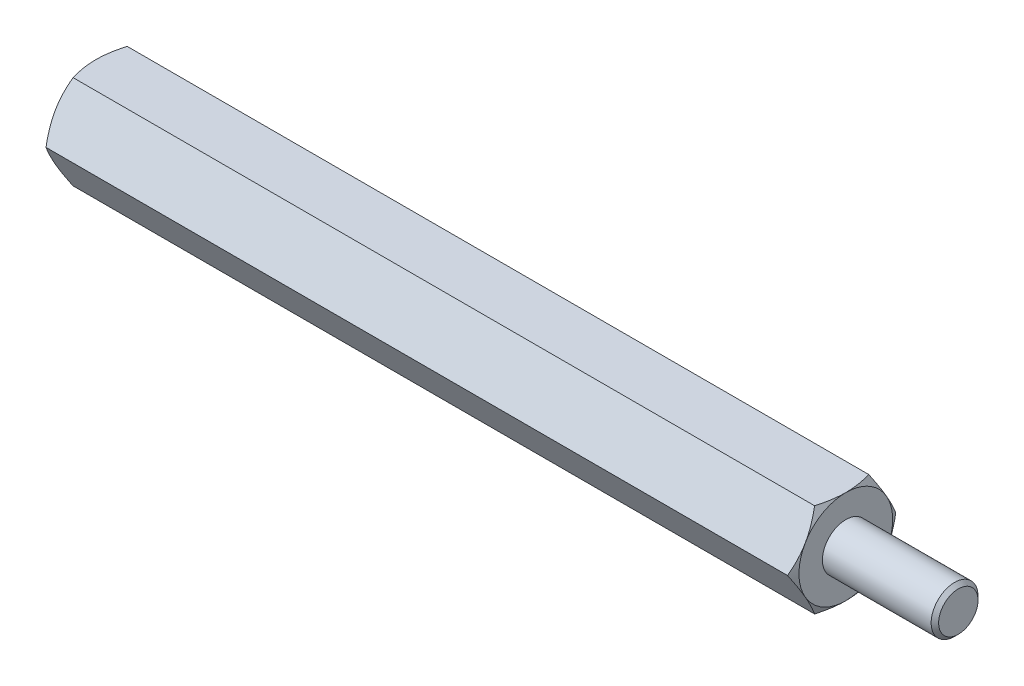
ISO-10303-21;
HEADER;
FILE_DESCRIPTION(('STEP AP214'),'2;1');
FILE_NAME('part.step','',(''),(''),'','','');
FILE_SCHEMA(('AUTOMOTIVE_DESIGN { 1 0 10303 214 1 1 1 1 }'));
ENDSEC;
DATA;
#1=APPLICATION_CONTEXT('core data for automotive mechanical design processes');
#2=APPLICATION_PROTOCOL_DEFINITION('international standard','automotive_design',2000,#1);
#3=PRODUCT_CONTEXT('',#1,'mechanical');
#4=PRODUCT('Part','Part','',(#3));
#5=PRODUCT_RELATED_PRODUCT_CATEGORY('part','',(#4));
#6=PRODUCT_DEFINITION_FORMATION('','',#4);
#7=PRODUCT_DEFINITION_CONTEXT('part definition',#1,'design');
#8=PRODUCT_DEFINITION('design','',#6,#7);
#9=PRODUCT_DEFINITION_SHAPE('','',#8);
#10=(LENGTH_UNIT() NAMED_UNIT(*) SI_UNIT(.MILLI.,.METRE.));
#11=(NAMED_UNIT(*) PLANE_ANGLE_UNIT() SI_UNIT($,.RADIAN.));
#12=(NAMED_UNIT(*) SI_UNIT($,.STERADIAN.) SOLID_ANGLE_UNIT());
#13=UNCERTAINTY_MEASURE_WITH_UNIT(LENGTH_MEASURE(1.E-05),#10,'distance_accuracy_value','');
#14=(GEOMETRIC_REPRESENTATION_CONTEXT(3) GLOBAL_UNCERTAINTY_ASSIGNED_CONTEXT((#13)) GLOBAL_UNIT_ASSIGNED_CONTEXT((#10,
#11,#12)) REPRESENTATION_CONTEXT('',''));
#15=CARTESIAN_POINT('',(0.,0.,0.));
#16=DIRECTION('',(0.,0.,1.));
#17=DIRECTION('',(1.,0.,0.));
#18=AXIS2_PLACEMENT_3D('',#15,#16,#17);
#19=CARTESIAN_POINT('',(20.,2.5,-1.44337567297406));
#20=DIRECTION('',(1.,0.,0.));
#21=DIRECTION('',(0.,0.,-1.));
#22=AXIS2_PLACEMENT_3D('',#19,#20,#21);
#23=PLANE('',#22);
#24=CARTESIAN_POINT('',(20.,0.,0.));
#25=DIRECTION('',(1.,0.,0.));
#26=DIRECTION('',(0.,0.,-1.));
#27=AXIS2_PLACEMENT_3D('',#24,#25,#26);
#28=CIRCLE('',#27,2.5);
#29=CARTESIAN_POINT('',(20.,-1.25,-2.1650635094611));
#30=VERTEX_POINT('',#29);
#31=CARTESIAN_POINT('',(20.,1.25,-2.1650635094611));
#32=VERTEX_POINT('',#31);
#33=EDGE_CURVE('E288',#30,#32,#28,.T.);
#34=ORIENTED_EDGE('',*,*,#33,.T.);
#35=CARTESIAN_POINT('',(20.,2.5,0.));
#36=VERTEX_POINT('',#35);
#37=EDGE_CURVE('E53',#32,#36,#28,.T.);
#38=ORIENTED_EDGE('',*,*,#37,.T.);
#39=CARTESIAN_POINT('',(20.,1.25,2.1650635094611));
#40=VERTEX_POINT('',#39);
#41=EDGE_CURVE('E295',#36,#40,#28,.T.);
#42=ORIENTED_EDGE('',*,*,#41,.T.);
#43=CARTESIAN_POINT('',(20.,-1.25000000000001,2.1650635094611));
#44=VERTEX_POINT('',#43);
#45=EDGE_CURVE('E300',#40,#44,#28,.T.);
#46=ORIENTED_EDGE('',*,*,#45,.T.);
#47=CARTESIAN_POINT('',(20.,0.,0.));
#48=DIRECTION('',(-1.,0.,0.));
#49=DIRECTION('',(0.,-1.,0.));
#50=AXIS2_PLACEMENT_3D('',#47,#48,#49);
#51=CIRCLE('',#50,2.5);
#52=CARTESIAN_POINT('',(20.,-2.50000000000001,0.));
#53=VERTEX_POINT('',#52);
#54=EDGE_CURVE('E193',#53,#44,#51,.T.);
#55=ORIENTED_EDGE('',*,*,#54,.F.);
#56=EDGE_CURVE('E61',#53,#30,#28,.T.);
#57=ORIENTED_EDGE('',*,*,#56,.T.);
#58=EDGE_LOOP('',(#34,#38,#42,#46,#55,#57));
#59=FACE_BOUND('',#58,.T.);
#60=CARTESIAN_POINT('',(20.,0.,0.));
#61=DIRECTION('',(1.,0.,0.));
#62=DIRECTION('',(0.,0.,-1.));
#63=AXIS2_PLACEMENT_3D('',#60,#61,#62);
#64=CIRCLE('',#63,1.25);
#65=CARTESIAN_POINT('',(20.,0.,-1.25));
#66=VERTEX_POINT('',#65);
#67=EDGE_CURVE('E311',#66,#66,#64,.T.);
#68=ORIENTED_EDGE('',*,*,#67,.F.);
#69=EDGE_LOOP('',(#68));
#70=FACE_BOUND('',#69,.T.);
#71=ADVANCED_FACE('F37',(#59,#70),#23,.T.);
#72=CARTESIAN_POINT('',(20.,0.,-2.88675134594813));
#73=DIRECTION('',(0.,-0.5,0.866025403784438));
#74=DIRECTION('',(0.,-0.866025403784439,-0.5));
#75=AXIS2_PLACEMENT_3D('',#72,#73,#74);
#76=PLANE('',#75);
#77=CARTESIAN_POINT('',(19.7766423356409,-0.000200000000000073,-2.88686681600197));
#78=CARTESIAN_POINT('',(19.8132783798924,0.109663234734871,-2.82343724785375));
#79=CARTESIAN_POINT('',(19.8465977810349,0.220474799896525,-2.75946016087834));
#80=CARTESIAN_POINT('',(19.9047577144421,0.444016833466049,-2.63039810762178));
#81=CARTESIAN_POINT('',(19.9295776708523,0.556751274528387,-2.5653108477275));
#82=CARTESIAN_POINT('',(19.968214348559,0.780822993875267,-2.43594298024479));
#83=CARTESIAN_POINT('',(19.9822882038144,0.892125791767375,-2.37168227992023));
#84=CARTESIAN_POINT('',(19.9990908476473,1.11525522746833,-2.24285844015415));
#85=CARTESIAN_POINT('',(20.0018335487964,1.22708105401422,-2.17829576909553));
#86=CARTESIAN_POINT('',(19.9961342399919,1.43604197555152,-2.05765212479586));
#87=CARTESIAN_POINT('',(19.9890916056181,1.53320831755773,-2.0015531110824));
#88=CARTESIAN_POINT('',(19.9667685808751,1.726907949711,-1.88972057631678));
#89=CARTESIAN_POINT('',(19.9514805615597,1.82344056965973,-1.8339874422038));
#90=CARTESIAN_POINT('',(19.9132609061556,2.01753972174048,-1.7219242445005));
#91=CARTESIAN_POINT('',(19.8901672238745,2.11508168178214,-1.66560836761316));
#92=CARTESIAN_POINT('',(19.8377533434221,2.30871060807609,-1.55381665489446));
#93=CARTESIAN_POINT('',(19.8084454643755,2.40480005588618,-1.49833938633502));
#94=CARTESIAN_POINT('',(19.7766423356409,2.5002,-1.44326020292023));
#95=B_SPLINE_CURVE_WITH_KNOTS('',3,(#77,#78,#79,#80,#81,#82,#83,#84,#85,#86,#87,#88,#89,#90,#91,
#92,#93,#94),.UNSPECIFIED.,.F.,.F.,(4,2,2,2,2,2,2,2,4),(0.,0.396285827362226,0.793524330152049,
1.18093086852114,1.56786160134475,1.90479741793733,2.24204551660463,2.58677531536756,
2.93082800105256),.UNSPECIFIED.);
#96=CARTESIAN_POINT('',(19.7767090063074,0.,-2.88675134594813));
#97=VERTEX_POINT('',#96);
#98=EDGE_CURVE('E401',#97,#32,#95,.T.);
#99=ORIENTED_EDGE('',*,*,#98,.F.);
#100=DIRECTION('',(-1.,0.,0.));
#101=VECTOR('',#100,1.);
#102=CARTESIAN_POINT('',(20.,0.,-2.88675134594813));
#103=LINE('',#102,#101);
#104=CARTESIAN_POINT('',(-19.7767090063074,0.,-2.88675134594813));
#105=VERTEX_POINT('',#104);
#106=EDGE_CURVE('E264',#97,#105,#103,.T.);
#107=ORIENTED_EDGE('',*,*,#106,.T.);
#108=CARTESIAN_POINT('',(-19.7766423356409,2.5002,-1.44326020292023));
#109=CARTESIAN_POINT('',(-19.8132783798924,2.39033676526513,-1.50668977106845));
#110=CARTESIAN_POINT('',(-19.8465977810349,2.27952520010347,-1.57066685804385));
#111=CARTESIAN_POINT('',(-19.9047577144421,2.05598316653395,-1.69972891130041));
#112=CARTESIAN_POINT('',(-19.9295776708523,1.94324872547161,-1.7648161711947));
#113=CARTESIAN_POINT('',(-19.968214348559,1.71917700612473,-1.8941840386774));
#114=CARTESIAN_POINT('',(-19.9822882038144,1.60787420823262,-1.95844473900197));
#115=CARTESIAN_POINT('',(-19.9990908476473,1.38474477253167,-2.08726857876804));
#116=CARTESIAN_POINT('',(-20.0018335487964,1.27291894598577,-2.15183124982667));
#117=CARTESIAN_POINT('',(-19.9961342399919,1.06395802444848,-2.27247489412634));
#118=CARTESIAN_POINT('',(-19.9890916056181,0.96679168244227,-2.32857390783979));
#119=CARTESIAN_POINT('',(-19.9667685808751,0.773092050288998,-2.44040644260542));
#120=CARTESIAN_POINT('',(-19.9514805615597,0.676559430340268,-2.49613957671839));
#121=CARTESIAN_POINT('',(-19.9132609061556,0.482460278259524,-2.60820277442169));
#122=CARTESIAN_POINT('',(-19.8901672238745,0.38491831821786,-2.66451865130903));
#123=CARTESIAN_POINT('',(-19.8377533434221,0.191289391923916,-2.77631036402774));
#124=CARTESIAN_POINT('',(-19.8084454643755,0.0951999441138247,-2.83178763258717));
#125=CARTESIAN_POINT('',(-19.7766423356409,-0.000199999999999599,-2.88686681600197));
#126=B_SPLINE_CURVE_WITH_KNOTS('',3,(#108,#109,#110,#111,#112,#113,#114,#115,#116,#117,#118,
#119,#120,#121,#122,#123,#124,#125),.UNSPECIFIED.,.F.,.F.,(4,2,2,2,2,2,2,2,4),(0.,
0.396285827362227,0.79352433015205,1.18093086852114,1.56786160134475,1.90479741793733,
2.24204551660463,2.58677531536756,2.93082800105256),.UNSPECIFIED.);
#127=CARTESIAN_POINT('',(-20.,1.25,-2.1650635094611));
#128=VERTEX_POINT('',#127);
#129=EDGE_CURVE('E344',#128,#105,#126,.T.);
#130=ORIENTED_EDGE('',*,*,#129,.F.);
#131=CARTESIAN_POINT('',(-19.7767090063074,2.5,-1.44337567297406));
#132=VERTEX_POINT('',#131);
#133=EDGE_CURVE('E347',#132,#128,#126,.T.);
#134=ORIENTED_EDGE('',*,*,#133,.F.);
#135=DIRECTION('',(-1.,0.,0.));
#136=VECTOR('',#135,1.);
#137=CARTESIAN_POINT('',(20.,2.5,-1.44337567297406));
#138=LINE('',#137,#136);
#139=CARTESIAN_POINT('',(19.7767090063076,2.5,-1.44337567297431));
#140=VERTEX_POINT('',#139);
#141=EDGE_CURVE('E279',#140,#132,#138,.T.);
#142=ORIENTED_EDGE('',*,*,#141,.F.);
#143=EDGE_CURVE('E229',#32,#140,#95,.T.);
#144=ORIENTED_EDGE('',*,*,#143,.F.);
#145=EDGE_LOOP('',(#99,#107,#130,#134,#142,#144));
#146=FACE_BOUND('',#145,.T.);
#147=ADVANCED_FACE('F148',(#146),#76,.F.);
#148=CARTESIAN_POINT('',(20.,2.5,-1.44337567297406));
#149=DIRECTION('',(0.,-1.,0.));
#150=DIRECTION('',(0.,0.,-1.));
#151=AXIS2_PLACEMENT_3D('',#148,#149,#150);
#152=PLANE('',#151);
#153=CARTESIAN_POINT('',(18.7680338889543,2.5,-3.90158441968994));
#154=CARTESIAN_POINT('',(18.8212077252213,2.5,-3.79217004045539));
#155=CARTESIAN_POINT('',(18.8738786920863,2.5,-3.68250707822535));
#156=CARTESIAN_POINT('',(18.9779324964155,2.5,-3.46255185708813));
#157=CARTESIAN_POINT('',(19.0293151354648,2.5,-3.35225950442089));
#158=CARTESIAN_POINT('',(19.1307630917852,2.5,-3.13035696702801));
#159=CARTESIAN_POINT('',(19.1808199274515,2.5,-3.0187428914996));
#160=CARTESIAN_POINT('',(19.2789171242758,2.5,-2.79463535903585));
#161=CARTESIAN_POINT('',(19.3269575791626,2.5,-2.68214194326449));
#162=CARTESIAN_POINT('',(19.4220184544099,2.5,-2.45240385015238));
#163=CARTESIAN_POINT('',(19.4689543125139,2.5,-2.33512399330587));
#164=CARTESIAN_POINT('',(19.5593326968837,2.5,-2.09920133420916));
#165=CARTESIAN_POINT('',(19.6027748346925,2.5,-1.98055838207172));
#166=CARTESIAN_POINT('',(19.6850435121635,2.5,-1.74193489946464));
#167=CARTESIAN_POINT('',(19.7238791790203,2.5,-1.6219575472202));
#168=CARTESIAN_POINT('',(19.7957050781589,2.5,-1.38028205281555));
#169=CARTESIAN_POINT('',(19.8286971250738,2.5,-1.25858445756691));
#170=CARTESIAN_POINT('',(19.8870959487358,2.5,-1.01406369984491));
#171=CARTESIAN_POINT('',(19.9125437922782,2.5,-0.891250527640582));
#172=CARTESIAN_POINT('',(19.9544275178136,2.5,-0.644071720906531));
#173=CARTESIAN_POINT('',(19.9708643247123,2.5,-0.519706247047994));
#174=CARTESIAN_POINT('',(19.9932006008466,2.5,-0.271679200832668));
#175=CARTESIAN_POINT('',(19.9992375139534,2.5,-0.148030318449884));
#176=CARTESIAN_POINT('',(20.0006256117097,2.5,0.0993395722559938));
#177=CARTESIAN_POINT('',(19.9959765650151,2.5,0.223060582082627));
#178=CARTESIAN_POINT('',(19.9794044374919,2.5,0.432351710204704));
#179=CARTESIAN_POINT('',(19.9701066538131,2.5,0.518143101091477));
#180=CARTESIAN_POINT('',(19.9469384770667,2.5,0.689112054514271));
#181=CARTESIAN_POINT('',(19.9330674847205,2.5,0.774289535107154));
#182=CARTESIAN_POINT('',(19.8853202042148,2.5,1.02876599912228));
#183=CARTESIAN_POINT('',(19.8453176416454,2.5,1.19691958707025));
#184=CARTESIAN_POINT('',(19.7522656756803,2.5,1.53362893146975));
#185=CARTESIAN_POINT('',(19.6989362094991,2.5,1.70210423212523));
#186=CARTESIAN_POINT('',(19.6123716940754,2.5,1.95247339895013));
#187=CARTESIAN_POINT('',(19.5824247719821,2.5,2.0355318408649));
#188=CARTESIAN_POINT('',(19.5206840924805,2.5,2.20095860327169));
#189=CARTESIAN_POINT('',(19.4888903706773,2.5,2.28332693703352));
#190=CARTESIAN_POINT('',(19.404014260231,2.5,2.49723312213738));
#191=CARTESIAN_POINT('',(19.3497173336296,2.5,2.62828796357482));
#192=CARTESIAN_POINT('',(19.2381273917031,2.5,2.88912034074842));
#193=CARTESIAN_POINT('',(19.1808341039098,2.5,3.01889775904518));
#194=CARTESIAN_POINT('',(19.0639348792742,2.5,3.27745045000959));
#195=CARTESIAN_POINT('',(19.004328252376,2.5,3.40622540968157));
#196=CARTESIAN_POINT('',(18.8833234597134,2.5,3.66293235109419));
#197=CARTESIAN_POINT('',(18.821925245,2.5,3.7908643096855));
#198=CARTESIAN_POINT('',(18.6354580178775,2.5,4.17399495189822));
#199=CARTESIAN_POINT('',(18.5082824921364,2.5,4.42816724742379));
#200=CARTESIAN_POINT('',(18.2503455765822,2.5,4.9346146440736));
#201=CARTESIAN_POINT('',(18.1195848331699,2.5,5.1868900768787));
#202=CARTESIAN_POINT('',(17.8687100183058,2.5,5.66512451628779));
#203=CARTESIAN_POINT('',(17.7488298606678,2.5,5.89120644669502));
#204=CARTESIAN_POINT('',(17.5075902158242,2.5,6.34259369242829));
#205=CARTESIAN_POINT('',(17.3862306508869,2.5,6.56789896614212));
#206=CARTESIAN_POINT('',(17.142780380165,2.5,7.01722044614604));
#207=CARTESIAN_POINT('',(17.0206930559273,2.5,7.24123848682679));
#208=CARTESIAN_POINT('',(16.7756662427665,2.5,7.68878772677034));
#209=CARTESIAN_POINT('',(16.652726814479,2.5,7.91231895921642));
#210=CARTESIAN_POINT('',(16.5294756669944,2.5,8.1356769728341));
#211=B_SPLINE_CURVE_WITH_KNOTS('',3,(#153,#154,#155,#156,#157,#158,#159,#160,#161,#162,#163,
#164,#165,#166,#167,#168,#169,#170,#171,#172,#173,#174,#175,#176,#177,#178,#179,#180,#181,#182,
#183,#184,#185,#186,#187,#188,#189,#190,#191,#192,#193,#194,#195,#196,#197,#198,#199,#200,#201,
#202,#203,#204,#205,#206,#207,#208,#209,#210),.UNSPECIFIED.,.F.,.F.,(4,2,2,2,2,2,2,2,2,2,2,2,2,
2,2,2,2,2,2,2,2,2,2,2,2,2,2,2,4),(0.,0.364957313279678,0.729970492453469,1.09692930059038,
1.46387103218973,1.84279746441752,2.22176597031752,2.59997058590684,2.97805755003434,
3.35404692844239,3.72999770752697,4.10094071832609,4.47189175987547,4.73064905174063,
4.98944026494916,5.50729076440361,6.03710483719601,6.30196454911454,6.56681915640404,
6.99233818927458,7.41789598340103,7.84358170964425,8.26927907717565,9.12186602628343,
9.97430025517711,10.7419897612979,11.5097197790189,12.2750964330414,13.0404191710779),.UNSPECIFIED.);
#212=EDGE_CURVE('E227',#140,#36,#211,.T.);
#213=ORIENTED_EDGE('',*,*,#212,.F.);
#214=ORIENTED_EDGE('',*,*,#141,.T.);
#215=CARTESIAN_POINT('',(-18.7680338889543,2.5,-3.90158441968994));
#216=CARTESIAN_POINT('',(-18.8212077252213,2.5,-3.79217004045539));
#217=CARTESIAN_POINT('',(-18.8738786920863,2.5,-3.68250707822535));
#218=CARTESIAN_POINT('',(-18.9779324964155,2.5,-3.46255185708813));
#219=CARTESIAN_POINT('',(-19.0293151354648,2.5,-3.35225950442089));
#220=CARTESIAN_POINT('',(-19.1307630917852,2.5,-3.13035696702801));
#221=CARTESIAN_POINT('',(-19.1808199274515,2.5,-3.0187428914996));
#222=CARTESIAN_POINT('',(-19.2789171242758,2.5,-2.79463535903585));
#223=CARTESIAN_POINT('',(-19.3269575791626,2.5,-2.68214194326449));
#224=CARTESIAN_POINT('',(-19.4220184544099,2.5,-2.45240385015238));
#225=CARTESIAN_POINT('',(-19.4689543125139,2.5,-2.33512399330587));
#226=CARTESIAN_POINT('',(-19.5593326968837,2.5,-2.09920133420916));
#227=CARTESIAN_POINT('',(-19.6027748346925,2.5,-1.98055838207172));
#228=CARTESIAN_POINT('',(-19.6850435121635,2.5,-1.74193489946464));
#229=CARTESIAN_POINT('',(-19.7238791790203,2.5,-1.6219575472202));
#230=CARTESIAN_POINT('',(-19.7957050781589,2.5,-1.38028205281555));
#231=CARTESIAN_POINT('',(-19.8286971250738,2.5,-1.25858445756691));
#232=CARTESIAN_POINT('',(-19.8870959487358,2.5,-1.01406369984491));
#233=CARTESIAN_POINT('',(-19.9125437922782,2.5,-0.891250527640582));
#234=CARTESIAN_POINT('',(-19.9544275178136,2.5,-0.644071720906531));
#235=CARTESIAN_POINT('',(-19.9708643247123,2.5,-0.519706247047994));
#236=CARTESIAN_POINT('',(-19.9932006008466,2.5,-0.271679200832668));
#237=CARTESIAN_POINT('',(-19.9992375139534,2.5,-0.148030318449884));
#238=CARTESIAN_POINT('',(-20.0006256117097,2.5,0.0993395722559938));
#239=CARTESIAN_POINT('',(-19.9959765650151,2.5,0.223060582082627));
#240=CARTESIAN_POINT('',(-19.9794044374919,2.5,0.432351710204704));
#241=CARTESIAN_POINT('',(-19.9701066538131,2.5,0.518143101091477));
#242=CARTESIAN_POINT('',(-19.9469384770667,2.5,0.689112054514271));
#243=CARTESIAN_POINT('',(-19.9330674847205,2.5,0.774289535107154));
#244=CARTESIAN_POINT('',(-19.8853202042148,2.5,1.02876599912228));
#245=CARTESIAN_POINT('',(-19.8453176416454,2.5,1.19691958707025));
#246=CARTESIAN_POINT('',(-19.7522656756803,2.5,1.53362893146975));
#247=CARTESIAN_POINT('',(-19.6989362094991,2.5,1.70210423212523));
#248=CARTESIAN_POINT('',(-19.6123716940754,2.5,1.95247339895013));
#249=CARTESIAN_POINT('',(-19.5824247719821,2.5,2.0355318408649));
#250=CARTESIAN_POINT('',(-19.5206840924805,2.5,2.20095860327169));
#251=CARTESIAN_POINT('',(-19.4888903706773,2.5,2.28332693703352));
#252=CARTESIAN_POINT('',(-19.404014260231,2.5,2.49723312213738));
#253=CARTESIAN_POINT('',(-19.3497173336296,2.5,2.62828796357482));
#254=CARTESIAN_POINT('',(-19.2381273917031,2.5,2.88912034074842));
#255=CARTESIAN_POINT('',(-19.1808341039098,2.5,3.01889775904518));
#256=CARTESIAN_POINT('',(-19.0639348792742,2.5,3.27745045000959));
#257=CARTESIAN_POINT('',(-19.004328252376,2.5,3.40622540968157));
#258=CARTESIAN_POINT('',(-18.8833234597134,2.5,3.66293235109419));
#259=CARTESIAN_POINT('',(-18.821925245,2.5,3.7908643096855));
#260=CARTESIAN_POINT('',(-18.6354580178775,2.5,4.17399495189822));
#261=CARTESIAN_POINT('',(-18.5082824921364,2.5,4.42816724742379));
#262=CARTESIAN_POINT('',(-18.2503455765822,2.5,4.9346146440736));
#263=CARTESIAN_POINT('',(-18.1195848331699,2.5,5.1868900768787));
#264=CARTESIAN_POINT('',(-17.8687100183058,2.5,5.66512451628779));
#265=CARTESIAN_POINT('',(-17.7488298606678,2.5,5.89120644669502));
#266=CARTESIAN_POINT('',(-17.5075902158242,2.5,6.34259369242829));
#267=CARTESIAN_POINT('',(-17.3862306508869,2.5,6.56789896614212));
#268=CARTESIAN_POINT('',(-17.142780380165,2.5,7.01722044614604));
#269=CARTESIAN_POINT('',(-17.0206930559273,2.5,7.24123848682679));
#270=CARTESIAN_POINT('',(-16.7756662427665,2.5,7.68878772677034));
#271=CARTESIAN_POINT('',(-16.652726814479,2.5,7.91231895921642));
#272=CARTESIAN_POINT('',(-16.5294756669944,2.5,8.1356769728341));
#273=B_SPLINE_CURVE_WITH_KNOTS('',3,(#215,#216,#217,#218,#219,#220,#221,#222,#223,#224,#225,
#226,#227,#228,#229,#230,#231,#232,#233,#234,#235,#236,#237,#238,#239,#240,#241,#242,#243,#244,
#245,#246,#247,#248,#249,#250,#251,#252,#253,#254,#255,#256,#257,#258,#259,#260,#261,#262,#263,
#264,#265,#266,#267,#268,#269,#270,#271,#272),.UNSPECIFIED.,.F.,.F.,(4,2,2,2,2,2,2,2,2,2,2,2,2,
2,2,2,2,2,2,2,2,2,2,2,2,2,2,2,4),(0.,0.364957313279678,0.729970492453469,1.09692930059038,
1.46387103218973,1.84279746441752,2.22176597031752,2.59997058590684,2.97805755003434,
3.35404692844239,3.72999770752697,4.10094071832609,4.47189175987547,4.73064905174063,
4.98944026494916,5.50729076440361,6.03710483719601,6.30196454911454,6.56681915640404,
6.99233818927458,7.41789598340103,7.84358170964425,8.26927907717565,9.12186602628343,
9.97430025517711,10.7419897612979,11.5097197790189,12.2750964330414,13.0404191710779),.UNSPECIFIED.);
#274=CARTESIAN_POINT('',(-20.,2.5,0.));
#275=VERTEX_POINT('',#274);
#276=EDGE_CURVE('E241',#275,#132,#273,.F.);
#277=ORIENTED_EDGE('',*,*,#276,.F.);
#278=CARTESIAN_POINT('',(-19.7767090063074,2.5,1.44337567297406));
#279=VERTEX_POINT('',#278);
#280=EDGE_CURVE('E249',#279,#275,#273,.F.);
#281=ORIENTED_EDGE('',*,*,#280,.F.);
#282=DIRECTION('',(-1.,0.,0.));
#283=VECTOR('',#282,1.);
#284=CARTESIAN_POINT('',(20.,2.5,1.44337567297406));
#285=LINE('',#284,#283);
#286=CARTESIAN_POINT('',(19.7767090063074,2.5,1.44337567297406));
#287=VERTEX_POINT('',#286);
#288=EDGE_CURVE('E276',#287,#279,#285,.T.);
#289=ORIENTED_EDGE('',*,*,#288,.F.);
#290=EDGE_CURVE('E221',#36,#287,#211,.T.);
#291=ORIENTED_EDGE('',*,*,#290,.F.);
#292=EDGE_LOOP('',(#213,#214,#277,#281,#289,#291));
#293=FACE_BOUND('',#292,.T.);
#294=ADVANCED_FACE('F153',(#293),#152,.F.);
#295=CARTESIAN_POINT('',(20.,2.5,1.44337567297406));
#296=DIRECTION('',(0.,-0.5,-0.866025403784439));
#297=DIRECTION('',(0.,0.866025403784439,-0.5));
#298=AXIS2_PLACEMENT_3D('',#295,#296,#297);
#299=PLANE('',#298);
#300=CARTESIAN_POINT('',(19.7766423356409,2.5002,1.44326020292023));
#301=CARTESIAN_POINT('',(19.8132783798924,2.39033676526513,1.50668977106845));
#302=CARTESIAN_POINT('',(19.8465977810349,2.27952520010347,1.57066685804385));
#303=CARTESIAN_POINT('',(19.9047577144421,2.05598316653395,1.69972891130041));
#304=CARTESIAN_POINT('',(19.9295776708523,1.94324872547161,1.7648161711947));
#305=CARTESIAN_POINT('',(19.9682143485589,1.71917700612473,1.8941840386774));
#306=CARTESIAN_POINT('',(19.9822882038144,1.60787420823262,1.95844473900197));
#307=CARTESIAN_POINT('',(19.9990908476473,1.38474477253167,2.08726857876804));
#308=CARTESIAN_POINT('',(20.0018335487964,1.27291894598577,2.15183124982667));
#309=CARTESIAN_POINT('',(19.9961342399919,1.06395802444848,2.27247489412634));
#310=CARTESIAN_POINT('',(19.9890916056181,0.96679168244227,2.32857390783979));
#311=CARTESIAN_POINT('',(19.9667685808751,0.773092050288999,2.44040644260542));
#312=CARTESIAN_POINT('',(19.9514805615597,0.676559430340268,2.49613957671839));
#313=CARTESIAN_POINT('',(19.9132609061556,0.482460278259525,2.60820277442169));
#314=CARTESIAN_POINT('',(19.8901672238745,0.38491831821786,2.66451865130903));
#315=CARTESIAN_POINT('',(19.8377533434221,0.191289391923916,2.77631036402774));
#316=CARTESIAN_POINT('',(19.8084454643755,0.0951999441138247,2.83178763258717));
#317=CARTESIAN_POINT('',(19.7766423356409,-0.000199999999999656,2.88686681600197));
#318=B_SPLINE_CURVE_WITH_KNOTS('',3,(#300,#301,#302,#303,#304,#305,#306,#307,#308,#309,#310,
#311,#312,#313,#314,#315,#316,#317),.UNSPECIFIED.,.F.,.F.,(4,2,2,2,2,2,2,2,4),(0.,
0.396285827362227,0.793524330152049,1.18093086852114,1.56786160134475,1.90479741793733,
2.24204551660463,2.58677531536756,2.93082800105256),.UNSPECIFIED.);
#319=EDGE_CURVE('E228',#287,#40,#318,.T.);
#320=ORIENTED_EDGE('',*,*,#319,.F.);
#321=ORIENTED_EDGE('',*,*,#288,.T.);
#322=CARTESIAN_POINT('',(-19.7766423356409,-0.000199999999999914,2.88686681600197));
#323=CARTESIAN_POINT('',(-19.8132783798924,0.109663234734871,2.82343724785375));
#324=CARTESIAN_POINT('',(-19.8465977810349,0.220474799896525,2.75946016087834));
#325=CARTESIAN_POINT('',(-19.9047577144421,0.444016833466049,2.63039810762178));
#326=CARTESIAN_POINT('',(-19.9295776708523,0.556751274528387,2.5653108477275));
#327=CARTESIAN_POINT('',(-19.968214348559,0.780822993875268,2.43594298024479));
#328=CARTESIAN_POINT('',(-19.9822882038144,0.892125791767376,2.37168227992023));
#329=CARTESIAN_POINT('',(-19.9990908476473,1.11525522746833,2.24285844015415));
#330=CARTESIAN_POINT('',(-20.0018335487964,1.22708105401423,2.17829576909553));
#331=CARTESIAN_POINT('',(-19.9961342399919,1.43604197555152,2.05765212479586));
#332=CARTESIAN_POINT('',(-19.9890916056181,1.53320831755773,2.0015531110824));
#333=CARTESIAN_POINT('',(-19.9667685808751,1.726907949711,1.88972057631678));
#334=CARTESIAN_POINT('',(-19.9514805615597,1.82344056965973,1.8339874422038));
#335=CARTESIAN_POINT('',(-19.9132609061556,2.01753972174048,1.7219242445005));
#336=CARTESIAN_POINT('',(-19.8901672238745,2.11508168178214,1.66560836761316));
#337=CARTESIAN_POINT('',(-19.8377533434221,2.30871060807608,1.55381665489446));
#338=CARTESIAN_POINT('',(-19.8084454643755,2.40480005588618,1.49833938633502));
#339=CARTESIAN_POINT('',(-19.7766423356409,2.5002,1.44326020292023));
#340=B_SPLINE_CURVE_WITH_KNOTS('',3,(#322,#323,#324,#325,#326,#327,#328,#329,#330,#331,#332,
#333,#334,#335,#336,#337,#338,#339),.UNSPECIFIED.,.F.,.F.,(4,2,2,2,2,2,2,2,4),(0.,
0.396285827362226,0.793524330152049,1.18093086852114,1.56786160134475,1.90479741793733,
2.24204551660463,2.58677531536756,2.93082800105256),.UNSPECIFIED.);
#341=CARTESIAN_POINT('',(-20.,1.25,2.1650635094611));
#342=VERTEX_POINT('',#341);
#343=EDGE_CURVE('E255',#342,#279,#340,.T.);
#344=ORIENTED_EDGE('',*,*,#343,.F.);
#345=CARTESIAN_POINT('',(-19.7767090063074,0.,2.88675134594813));
#346=VERTEX_POINT('',#345);
#347=EDGE_CURVE('E262',#346,#342,#340,.T.);
#348=ORIENTED_EDGE('',*,*,#347,.F.);
#349=DIRECTION('',(-1.,0.,0.));
#350=VECTOR('',#349,1.);
#351=CARTESIAN_POINT('',(20.,0.,2.88675134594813));
#352=LINE('',#351,#350);
#353=CARTESIAN_POINT('',(19.7767090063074,0.,2.88675134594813));
#354=VERTEX_POINT('',#353);
#355=EDGE_CURVE('E273',#354,#346,#352,.T.);
#356=ORIENTED_EDGE('',*,*,#355,.F.);
#357=EDGE_CURVE('E215',#40,#354,#318,.T.);
#358=ORIENTED_EDGE('',*,*,#357,.F.);
#359=EDGE_LOOP('',(#320,#321,#344,#348,#356,#358));
#360=FACE_BOUND('',#359,.T.);
#361=ADVANCED_FACE('F235',(#360),#299,.F.);
#362=CARTESIAN_POINT('',(20.,0.,2.88675134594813));
#363=DIRECTION('',(0.,0.5,-0.866025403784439));
#364=DIRECTION('',(0.,0.866025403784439,0.5));
#365=AXIS2_PLACEMENT_3D('',#362,#363,#364);
#366=PLANE('',#365);
#367=CARTESIAN_POINT('',(19.7766423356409,0.00020000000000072,2.88686681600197));
#368=CARTESIAN_POINT('',(19.8132783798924,-0.10966323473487,2.82343724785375));
#369=CARTESIAN_POINT('',(19.8465977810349,-0.220474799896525,2.75946016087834));
#370=CARTESIAN_POINT('',(19.9047577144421,-0.444016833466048,2.63039810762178));
#371=CARTESIAN_POINT('',(19.9295776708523,-0.556751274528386,2.5653108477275));
#372=CARTESIAN_POINT('',(19.968214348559,-0.780822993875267,2.43594298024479));
#373=CARTESIAN_POINT('',(19.9822882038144,-0.892125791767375,2.37168227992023));
#374=CARTESIAN_POINT('',(19.9990908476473,-1.11525522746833,2.24285844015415));
#375=CARTESIAN_POINT('',(20.0018335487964,-1.22708105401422,2.17829576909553));
#376=CARTESIAN_POINT('',(19.9961342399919,-1.43604197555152,2.05765212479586));
#377=CARTESIAN_POINT('',(19.9890916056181,-1.53320831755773,2.0015531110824));
#378=CARTESIAN_POINT('',(19.9667685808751,-1.726907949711,1.88972057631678));
#379=CARTESIAN_POINT('',(19.9514805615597,-1.82344056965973,1.8339874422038));
#380=CARTESIAN_POINT('',(19.9132609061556,-2.01753972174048,1.7219242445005));
#381=CARTESIAN_POINT('',(19.8901672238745,-2.11508168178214,1.66560836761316));
#382=CARTESIAN_POINT('',(19.8377533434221,-2.30871060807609,1.55381665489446));
#383=CARTESIAN_POINT('',(19.8084454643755,-2.40480005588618,1.49833938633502));
#384=CARTESIAN_POINT('',(19.7766423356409,-2.5002,1.44326020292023));
#385=B_SPLINE_CURVE_WITH_KNOTS('',3,(#367,#368,#369,#370,#371,#372,#373,#374,#375,#376,#377,
#378,#379,#380,#381,#382,#383,#384),.UNSPECIFIED.,.F.,.F.,(4,2,2,2,2,2,2,2,4),(0.,
0.396285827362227,0.793524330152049,1.18093086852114,1.56786160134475,1.90479741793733,
2.24204551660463,2.58677531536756,2.93082800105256),.UNSPECIFIED.);
#386=EDGE_CURVE('E413',#354,#44,#385,.T.);
#387=ORIENTED_EDGE('',*,*,#386,.F.);
#388=ORIENTED_EDGE('',*,*,#355,.T.);
#389=CARTESIAN_POINT('',(-19.7766423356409,-2.5002,1.44326020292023));
#390=CARTESIAN_POINT('',(-19.8132783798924,-2.39033676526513,1.50668977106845));
#391=CARTESIAN_POINT('',(-19.8465977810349,-2.27952520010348,1.57066685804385));
#392=CARTESIAN_POINT('',(-19.9047577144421,-2.05598316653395,1.69972891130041));
#393=CARTESIAN_POINT('',(-19.9295776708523,-1.94324872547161,1.76481617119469));
#394=CARTESIAN_POINT('',(-19.968214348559,-1.71917700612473,1.8941840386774));
#395=CARTESIAN_POINT('',(-19.9822882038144,-1.60787420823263,1.95844473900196));
#396=CARTESIAN_POINT('',(-19.9990908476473,-1.38474477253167,2.08726857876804));
#397=CARTESIAN_POINT('',(-20.0018335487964,-1.27291894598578,2.15183124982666));
#398=CARTESIAN_POINT('',(-19.9961342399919,-1.06395802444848,2.27247489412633));
#399=CARTESIAN_POINT('',(-19.9890916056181,-0.966791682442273,2.32857390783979));
#400=CARTESIAN_POINT('',(-19.9667685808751,-0.773092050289,2.44040644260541));
#401=CARTESIAN_POINT('',(-19.9514805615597,-0.67655943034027,2.49613957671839));
#402=CARTESIAN_POINT('',(-19.9132609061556,-0.482460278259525,2.60820277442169));
#403=CARTESIAN_POINT('',(-19.8901672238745,-0.38491831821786,2.66451865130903));
#404=CARTESIAN_POINT('',(-19.8377533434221,-0.191289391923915,2.77631036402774));
#405=CARTESIAN_POINT('',(-19.8084454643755,-0.0951999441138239,2.83178763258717));
#406=CARTESIAN_POINT('',(-19.7766423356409,0.000200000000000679,2.88686681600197));
#407=B_SPLINE_CURVE_WITH_KNOTS('',3,(#389,#390,#391,#392,#393,#394,#395,#396,#397,#398,#399,
#400,#401,#402,#403,#404,#405,#406),.UNSPECIFIED.,.F.,.F.,(4,2,2,2,2,2,2,2,4),(0.,
0.396285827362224,0.793524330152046,1.18093086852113,1.56786160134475,1.90479741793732,
2.24204551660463,2.58677531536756,2.93082800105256),.UNSPECIFIED.);
#408=CARTESIAN_POINT('',(-20.,-1.25000000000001,2.1650635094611));
#409=VERTEX_POINT('',#408);
#410=EDGE_CURVE('E263',#409,#346,#407,.T.);
#411=ORIENTED_EDGE('',*,*,#410,.F.);
#412=CARTESIAN_POINT('',(-19.7767090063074,-2.5,1.44337567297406));
#413=VERTEX_POINT('',#412);
#414=EDGE_CURVE('E250',#413,#409,#407,.T.);
#415=ORIENTED_EDGE('',*,*,#414,.F.);
#416=DIRECTION('',(-1.,0.,0.));
#417=VECTOR('',#416,1.);
#418=CARTESIAN_POINT('',(20.,-2.5,1.44337567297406));
#419=LINE('',#418,#417);
#420=CARTESIAN_POINT('',(19.7767090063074,-2.5,1.44337567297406));
#421=VERTEX_POINT('',#420);
#422=EDGE_CURVE('E270',#421,#413,#419,.T.);
#423=ORIENTED_EDGE('',*,*,#422,.F.);
#424=EDGE_CURVE('E210',#44,#421,#385,.T.);
#425=ORIENTED_EDGE('',*,*,#424,.F.);
#426=EDGE_LOOP('',(#387,#388,#411,#415,#423,#425));
#427=FACE_BOUND('',#426,.T.);
#428=ADVANCED_FACE('F425',(#427),#366,.F.);
#429=CARTESIAN_POINT('',(20.,-2.5,1.44337567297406));
#430=DIRECTION('',(0.,1.,0.));
#431=DIRECTION('',(0.,0.,1.));
#432=AXIS2_PLACEMENT_3D('',#429,#430,#431);
#433=PLANE('',#432);
#434=CARTESIAN_POINT('',(18.7680338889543,-2.5,-3.90158441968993));
#435=CARTESIAN_POINT('',(18.8212077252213,-2.5,-3.79217004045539));
#436=CARTESIAN_POINT('',(18.8738786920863,-2.5,-3.68250707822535));
#437=CARTESIAN_POINT('',(18.9779324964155,-2.5,-3.46255185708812));
#438=CARTESIAN_POINT('',(19.0293151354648,-2.5,-3.35225950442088));
#439=CARTESIAN_POINT('',(19.1307630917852,-2.5,-3.130356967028));
#440=CARTESIAN_POINT('',(19.1808199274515,-2.5,-3.0187428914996));
#441=CARTESIAN_POINT('',(19.2789171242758,-2.5,-2.79463535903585));
#442=CARTESIAN_POINT('',(19.3269575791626,-2.5,-2.68214194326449));
#443=CARTESIAN_POINT('',(19.4220184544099,-2.5,-2.45240385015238));
#444=CARTESIAN_POINT('',(19.4689543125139,-2.5,-2.33512399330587));
#445=CARTESIAN_POINT('',(19.5593326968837,-2.5,-2.09920133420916));
#446=CARTESIAN_POINT('',(19.6027748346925,-2.5,-1.98055838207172));
#447=CARTESIAN_POINT('',(19.6850435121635,-2.5,-1.74193489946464));
#448=CARTESIAN_POINT('',(19.7238791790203,-2.5,-1.6219575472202));
#449=CARTESIAN_POINT('',(19.7957050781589,-2.5,-1.38028205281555));
#450=CARTESIAN_POINT('',(19.8286971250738,-2.5,-1.25858445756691));
#451=CARTESIAN_POINT('',(19.8870959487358,-2.5,-1.01406369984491));
#452=CARTESIAN_POINT('',(19.9125437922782,-2.5,-0.891250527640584));
#453=CARTESIAN_POINT('',(19.9544275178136,-2.5,-0.644071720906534));
#454=CARTESIAN_POINT('',(19.9708643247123,-2.5,-0.519706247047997));
#455=CARTESIAN_POINT('',(19.9932006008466,-2.5,-0.271679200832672));
#456=CARTESIAN_POINT('',(19.9992375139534,-2.5,-0.148030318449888));
#457=CARTESIAN_POINT('',(20.0006256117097,-2.5,0.0993395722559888));
#458=CARTESIAN_POINT('',(19.9959765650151,-2.5,0.223060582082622));
#459=CARTESIAN_POINT('',(19.9794044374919,-2.5,0.432351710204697));
#460=CARTESIAN_POINT('',(19.9701066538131,-2.5,0.51814310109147));
#461=CARTESIAN_POINT('',(19.9469384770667,-2.5,0.689112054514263));
#462=CARTESIAN_POINT('',(19.9330674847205,-2.5,0.774289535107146));
#463=CARTESIAN_POINT('',(19.8853202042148,-2.5,1.02876599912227));
#464=CARTESIAN_POINT('',(19.8453176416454,-2.5,1.19691958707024));
#465=CARTESIAN_POINT('',(19.7522656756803,-2.5,1.53362893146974));
#466=CARTESIAN_POINT('',(19.6989362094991,-2.5,1.70210423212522));
#467=CARTESIAN_POINT('',(19.6123716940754,-2.5,1.95247339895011));
#468=CARTESIAN_POINT('',(19.5824247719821,-2.5,2.03553184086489));
#469=CARTESIAN_POINT('',(19.5206840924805,-2.5,2.20095860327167));
#470=CARTESIAN_POINT('',(19.4888903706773,-2.5,2.2833269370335));
#471=CARTESIAN_POINT('',(19.404014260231,-2.5,2.49723312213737));
#472=CARTESIAN_POINT('',(19.3497173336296,-2.5,2.62828796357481));
#473=CARTESIAN_POINT('',(19.2381273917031,-2.5,2.88912034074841));
#474=CARTESIAN_POINT('',(19.1808341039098,-2.5,3.01889775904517));
#475=CARTESIAN_POINT('',(19.0639348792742,-2.5,3.27745045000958));
#476=CARTESIAN_POINT('',(19.004328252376,-2.5,3.40622540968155));
#477=CARTESIAN_POINT('',(18.8833234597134,-2.5,3.66293235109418));
#478=CARTESIAN_POINT('',(18.821925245,-2.5,3.79086430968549));
#479=CARTESIAN_POINT('',(18.6354580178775,-2.5,4.17399495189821));
#480=CARTESIAN_POINT('',(18.5082824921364,-2.5,4.42816724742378));
#481=CARTESIAN_POINT('',(18.2503455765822,-2.5,4.93461464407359));
#482=CARTESIAN_POINT('',(18.1195848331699,-2.5,5.18689007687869));
#483=CARTESIAN_POINT('',(17.8687100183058,-2.5,5.66512451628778));
#484=CARTESIAN_POINT('',(17.7488298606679,-2.5,5.89120644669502));
#485=CARTESIAN_POINT('',(17.5075902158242,-2.5,6.34259369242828));
#486=CARTESIAN_POINT('',(17.3862306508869,-2.5,6.56789896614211));
#487=CARTESIAN_POINT('',(17.142780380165,-2.5,7.01722044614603));
#488=CARTESIAN_POINT('',(17.0206930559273,-2.5,7.24123848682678));
#489=CARTESIAN_POINT('',(16.7756662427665,-2.5,7.68878772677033));
#490=CARTESIAN_POINT('',(16.652726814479,-2.5,7.91231895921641));
#491=CARTESIAN_POINT('',(16.5294756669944,-2.5,8.13567697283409));
#492=B_SPLINE_CURVE_WITH_KNOTS('',3,(#434,#435,#436,#437,#438,#439,#440,#441,#442,#443,#444,
#445,#446,#447,#448,#449,#450,#451,#452,#453,#454,#455,#456,#457,#458,#459,#460,#461,#462,#463,
#464,#465,#466,#467,#468,#469,#470,#471,#472,#473,#474,#475,#476,#477,#478,#479,#480,#481,#482,
#483,#484,#485,#486,#487,#488,#489,#490,#491),.UNSPECIFIED.,.F.,.F.,(4,2,2,2,2,2,2,2,2,2,2,2,2,
2,2,2,2,2,2,2,2,2,2,2,2,2,2,2,4),(0.,0.364957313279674,0.729970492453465,1.09692930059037,
1.46387103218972,1.84279746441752,2.22176597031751,2.59997058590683,2.97805755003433,
3.35404692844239,3.72999770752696,4.10094071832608,4.47189175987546,4.73064905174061,
4.98944026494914,5.50729076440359,6.03710483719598,6.30196454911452,6.56681915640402,
6.99233818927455,7.41789598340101,7.84358170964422,8.26927907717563,9.12186602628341,
9.97430025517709,10.7419897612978,11.5097197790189,12.2750964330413,13.0404191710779),.UNSPECIFIED.);
#493=EDGE_CURVE('E417',#421,#53,#492,.F.);
#494=ORIENTED_EDGE('',*,*,#493,.F.);
#495=ORIENTED_EDGE('',*,*,#422,.T.);
#496=CARTESIAN_POINT('',(-18.7680338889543,-2.5,-3.90158441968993));
#497=CARTESIAN_POINT('',(-18.8212077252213,-2.5,-3.79217004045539));
#498=CARTESIAN_POINT('',(-18.8738786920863,-2.5,-3.68250707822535));
#499=CARTESIAN_POINT('',(-18.9779324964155,-2.5,-3.46255185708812));
#500=CARTESIAN_POINT('',(-19.0293151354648,-2.5,-3.35225950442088));
#501=CARTESIAN_POINT('',(-19.1307630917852,-2.5,-3.130356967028));
#502=CARTESIAN_POINT('',(-19.1808199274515,-2.5,-3.0187428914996));
#503=CARTESIAN_POINT('',(-19.2789171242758,-2.5,-2.79463535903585));
#504=CARTESIAN_POINT('',(-19.3269575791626,-2.5,-2.68214194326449));
#505=CARTESIAN_POINT('',(-19.4220184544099,-2.5,-2.45240385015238));
#506=CARTESIAN_POINT('',(-19.4689543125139,-2.5,-2.33512399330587));
#507=CARTESIAN_POINT('',(-19.5593326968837,-2.5,-2.09920133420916));
#508=CARTESIAN_POINT('',(-19.6027748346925,-2.5,-1.98055838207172));
#509=CARTESIAN_POINT('',(-19.6850435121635,-2.5,-1.74193489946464));
#510=CARTESIAN_POINT('',(-19.7238791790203,-2.5,-1.6219575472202));
#511=CARTESIAN_POINT('',(-19.7957050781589,-2.5,-1.38028205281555));
#512=CARTESIAN_POINT('',(-19.8286971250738,-2.5,-1.25858445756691));
#513=CARTESIAN_POINT('',(-19.8870959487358,-2.5,-1.01406369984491));
#514=CARTESIAN_POINT('',(-19.9125437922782,-2.5,-0.891250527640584));
#515=CARTESIAN_POINT('',(-19.9544275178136,-2.5,-0.644071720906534));
#516=CARTESIAN_POINT('',(-19.9708643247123,-2.5,-0.519706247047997));
#517=CARTESIAN_POINT('',(-19.9932006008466,-2.5,-0.271679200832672));
#518=CARTESIAN_POINT('',(-19.9992375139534,-2.5,-0.148030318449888));
#519=CARTESIAN_POINT('',(-20.0006256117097,-2.5,0.0993395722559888));
#520=CARTESIAN_POINT('',(-19.9959765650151,-2.5,0.223060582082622));
#521=CARTESIAN_POINT('',(-19.9794044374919,-2.5,0.432351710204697));
#522=CARTESIAN_POINT('',(-19.9701066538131,-2.5,0.51814310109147));
#523=CARTESIAN_POINT('',(-19.9469384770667,-2.5,0.689112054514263));
#524=CARTESIAN_POINT('',(-19.9330674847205,-2.5,0.774289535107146));
#525=CARTESIAN_POINT('',(-19.8853202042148,-2.5,1.02876599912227));
#526=CARTESIAN_POINT('',(-19.8453176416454,-2.5,1.19691958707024));
#527=CARTESIAN_POINT('',(-19.7522656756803,-2.5,1.53362893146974));
#528=CARTESIAN_POINT('',(-19.6989362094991,-2.5,1.70210423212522));
#529=CARTESIAN_POINT('',(-19.6123716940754,-2.5,1.95247339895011));
#530=CARTESIAN_POINT('',(-19.5824247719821,-2.5,2.03553184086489));
#531=CARTESIAN_POINT('',(-19.5206840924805,-2.5,2.20095860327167));
#532=CARTESIAN_POINT('',(-19.4888903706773,-2.5,2.2833269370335));
#533=CARTESIAN_POINT('',(-19.404014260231,-2.5,2.49723312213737));
#534=CARTESIAN_POINT('',(-19.3497173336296,-2.5,2.62828796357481));
#535=CARTESIAN_POINT('',(-19.2381273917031,-2.5,2.88912034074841));
#536=CARTESIAN_POINT('',(-19.1808341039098,-2.5,3.01889775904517));
#537=CARTESIAN_POINT('',(-19.0639348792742,-2.5,3.27745045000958));
#538=CARTESIAN_POINT('',(-19.004328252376,-2.5,3.40622540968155));
#539=CARTESIAN_POINT('',(-18.8833234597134,-2.5,3.66293235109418));
#540=CARTESIAN_POINT('',(-18.821925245,-2.5,3.79086430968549));
#541=CARTESIAN_POINT('',(-18.6354580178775,-2.5,4.17399495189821));
#542=CARTESIAN_POINT('',(-18.5082824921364,-2.5,4.42816724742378));
#543=CARTESIAN_POINT('',(-18.2503455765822,-2.5,4.93461464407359));
#544=CARTESIAN_POINT('',(-18.1195848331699,-2.5,5.18689007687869));
#545=CARTESIAN_POINT('',(-17.8687100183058,-2.5,5.66512451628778));
#546=CARTESIAN_POINT('',(-17.7488298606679,-2.5,5.89120644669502));
#547=CARTESIAN_POINT('',(-17.5075902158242,-2.5,6.34259369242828));
#548=CARTESIAN_POINT('',(-17.3862306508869,-2.5,6.56789896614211));
#549=CARTESIAN_POINT('',(-17.142780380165,-2.5,7.01722044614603));
#550=CARTESIAN_POINT('',(-17.0206930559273,-2.5,7.24123848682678));
#551=CARTESIAN_POINT('',(-16.7756662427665,-2.5,7.68878772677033));
#552=CARTESIAN_POINT('',(-16.652726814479,-2.5,7.91231895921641));
#553=CARTESIAN_POINT('',(-16.5294756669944,-2.5,8.13567697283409));
#554=B_SPLINE_CURVE_WITH_KNOTS('',3,(#496,#497,#498,#499,#500,#501,#502,#503,#504,#505,#506,
#507,#508,#509,#510,#511,#512,#513,#514,#515,#516,#517,#518,#519,#520,#521,#522,#523,#524,#525,
#526,#527,#528,#529,#530,#531,#532,#533,#534,#535,#536,#537,#538,#539,#540,#541,#542,#543,#544,
#545,#546,#547,#548,#549,#550,#551,#552,#553),.UNSPECIFIED.,.F.,.F.,(4,2,2,2,2,2,2,2,2,2,2,2,2,
2,2,2,2,2,2,2,2,2,2,2,2,2,2,2,4),(0.,0.364957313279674,0.729970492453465,1.09692930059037,
1.46387103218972,1.84279746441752,2.22176597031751,2.59997058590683,2.97805755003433,
3.35404692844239,3.72999770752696,4.10094071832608,4.47189175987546,4.73064905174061,
4.98944026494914,5.50729076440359,6.03710483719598,6.30196454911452,6.56681915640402,
6.99233818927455,7.41789598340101,7.84358170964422,8.26927907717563,9.12186602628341,
9.97430025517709,10.7419897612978,11.5097197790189,12.2750964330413,13.0404191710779),.UNSPECIFIED.);
#555=CARTESIAN_POINT('',(-20.,-2.50000000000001,0.));
#556=VERTEX_POINT('',#555);
#557=EDGE_CURVE('E352',#556,#413,#554,.T.);
#558=ORIENTED_EDGE('',*,*,#557,.F.);
#559=CARTESIAN_POINT('',(-19.7767090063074,-2.5,-1.44337567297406));
#560=VERTEX_POINT('',#559);
#561=EDGE_CURVE('E351',#560,#556,#554,.T.);
#562=ORIENTED_EDGE('',*,*,#561,.F.);
#563=DIRECTION('',(-1.,0.,0.));
#564=VECTOR('',#563,1.);
#565=CARTESIAN_POINT('',(20.,-2.5,-1.44337567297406));
#566=LINE('',#565,#564);
#567=CARTESIAN_POINT('',(19.7767090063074,-2.5,-1.44337567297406));
#568=VERTEX_POINT('',#567);
#569=EDGE_CURVE('E267',#568,#560,#566,.T.);
#570=ORIENTED_EDGE('',*,*,#569,.F.);
#571=EDGE_CURVE('E195',#53,#568,#492,.F.);
#572=ORIENTED_EDGE('',*,*,#571,.F.);
#573=EDGE_LOOP('',(#494,#495,#558,#562,#570,#572));
#574=FACE_BOUND('',#573,.T.);
#575=ADVANCED_FACE('F172',(#574),#433,.F.);
#576=CARTESIAN_POINT('',(20.,-2.5,-1.44337567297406));
#577=DIRECTION('',(0.,0.5,0.866025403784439));
#578=DIRECTION('',(0.,-0.866025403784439,0.5));
#579=AXIS2_PLACEMENT_3D('',#576,#577,#578);
#580=PLANE('',#579);
#581=CARTESIAN_POINT('',(19.7766423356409,-2.5002,-1.44326020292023));
#582=CARTESIAN_POINT('',(19.8132783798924,-2.39033676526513,-1.50668977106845));
#583=CARTESIAN_POINT('',(19.8465977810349,-2.27952520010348,-1.57066685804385));
#584=CARTESIAN_POINT('',(19.9047577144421,-2.05598316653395,-1.69972891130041));
#585=CARTESIAN_POINT('',(19.9295776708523,-1.94324872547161,-1.76481617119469));
#586=CARTESIAN_POINT('',(19.968214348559,-1.71917700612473,-1.8941840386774));
#587=CARTESIAN_POINT('',(19.9822882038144,-1.60787420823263,-1.95844473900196));
#588=CARTESIAN_POINT('',(19.9990908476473,-1.38474477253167,-2.08726857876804));
#589=CARTESIAN_POINT('',(20.0018335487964,-1.27291894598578,-2.15183124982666));
#590=CARTESIAN_POINT('',(19.9961342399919,-1.06395802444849,-2.27247489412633));
#591=CARTESIAN_POINT('',(19.9890916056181,-0.966791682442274,-2.32857390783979));
#592=CARTESIAN_POINT('',(19.9667685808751,-0.773092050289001,-2.44040644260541));
#593=CARTESIAN_POINT('',(19.9514805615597,-0.676559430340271,-2.49613957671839));
#594=CARTESIAN_POINT('',(19.9132609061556,-0.482460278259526,-2.60820277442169));
#595=CARTESIAN_POINT('',(19.8901672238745,-0.384918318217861,-2.66451865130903));
#596=CARTESIAN_POINT('',(19.8377533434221,-0.191289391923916,-2.77631036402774));
#597=CARTESIAN_POINT('',(19.8084454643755,-0.0951999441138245,-2.83178763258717));
#598=CARTESIAN_POINT('',(19.7766423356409,0.000199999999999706,-2.88686681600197));
#599=B_SPLINE_CURVE_WITH_KNOTS('',3,(#581,#582,#583,#584,#585,#586,#587,#588,#589,#590,#591,
#592,#593,#594,#595,#596,#597,#598),.UNSPECIFIED.,.F.,.F.,(4,2,2,2,2,2,2,2,4),(0.,
0.396285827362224,0.793524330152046,1.18093086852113,1.56786160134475,1.90479741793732,
2.24204551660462,2.58677531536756,2.93082800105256),.UNSPECIFIED.);
#600=EDGE_CURVE('E192',#568,#30,#599,.T.);
#601=ORIENTED_EDGE('',*,*,#600,.F.);
#602=ORIENTED_EDGE('',*,*,#569,.T.);
#603=CARTESIAN_POINT('',(-19.7766423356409,0.000200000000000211,-2.88686681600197));
#604=CARTESIAN_POINT('',(-19.8132783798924,-0.109663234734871,-2.82343724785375));
#605=CARTESIAN_POINT('',(-19.8465977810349,-0.220474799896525,-2.75946016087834));
#606=CARTESIAN_POINT('',(-19.9047577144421,-0.444016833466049,-2.63039810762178));
#607=CARTESIAN_POINT('',(-19.9295776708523,-0.556751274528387,-2.5653108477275));
#608=CARTESIAN_POINT('',(-19.968214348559,-0.780822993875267,-2.43594298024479));
#609=CARTESIAN_POINT('',(-19.9822882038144,-0.892125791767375,-2.37168227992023));
#610=CARTESIAN_POINT('',(-19.9990908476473,-1.11525522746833,-2.24285844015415));
#611=CARTESIAN_POINT('',(-20.0018335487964,-1.22708105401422,-2.17829576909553));
#612=CARTESIAN_POINT('',(-19.9961342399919,-1.43604197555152,-2.05765212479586));
#613=CARTESIAN_POINT('',(-19.9890916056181,-1.53320831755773,-2.0015531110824));
#614=CARTESIAN_POINT('',(-19.9667685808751,-1.726907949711,-1.88972057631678));
#615=CARTESIAN_POINT('',(-19.9514805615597,-1.82344056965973,-1.8339874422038));
#616=CARTESIAN_POINT('',(-19.9132609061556,-2.01753972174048,-1.7219242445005));
#617=CARTESIAN_POINT('',(-19.8901672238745,-2.11508168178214,-1.66560836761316));
#618=CARTESIAN_POINT('',(-19.8377533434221,-2.30871060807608,-1.55381665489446));
#619=CARTESIAN_POINT('',(-19.8084454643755,-2.40480005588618,-1.49833938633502));
#620=CARTESIAN_POINT('',(-19.7766423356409,-2.5002,-1.44326020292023));
#621=B_SPLINE_CURVE_WITH_KNOTS('',3,(#603,#604,#605,#606,#607,#608,#609,#610,#611,#612,#613,
#614,#615,#616,#617,#618,#619,#620),.UNSPECIFIED.,.F.,.F.,(4,2,2,2,2,2,2,2,4),(0.,
0.396285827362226,0.793524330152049,1.18093086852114,1.56786160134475,1.90479741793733,
2.24204551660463,2.58677531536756,2.93082800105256),.UNSPECIFIED.);
#622=CARTESIAN_POINT('',(-20.,-1.25,-2.1650635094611));
#623=VERTEX_POINT('',#622);
#624=EDGE_CURVE('E178',#623,#560,#621,.T.);
#625=ORIENTED_EDGE('',*,*,#624,.F.);
#626=EDGE_CURVE('E354',#105,#623,#621,.T.);
#627=ORIENTED_EDGE('',*,*,#626,.F.);
#628=ORIENTED_EDGE('',*,*,#106,.F.);
#629=EDGE_CURVE('E185',#30,#97,#599,.T.);
#630=ORIENTED_EDGE('',*,*,#629,.F.);
#631=EDGE_LOOP('',(#601,#602,#625,#627,#628,#630));
#632=FACE_BOUND('',#631,.T.);
#633=ADVANCED_FACE('F167',(#632),#580,.F.);
#634=CARTESIAN_POINT('',(-20.,0.,0.));
#635=DIRECTION('',(1.,0.,0.));
#636=DIRECTION('',(0.,1.,0.));
#637=AXIS2_PLACEMENT_3D('',#634,#635,#636);
#638=CONICAL_SURFACE('',#637,2.5,1.04719755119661);
#639=ORIENTED_EDGE('',*,*,#129,.T.);
#640=ORIENTED_EDGE('',*,*,#626,.T.);
#641=CARTESIAN_POINT('',(-20.,0.,0.));
#642=DIRECTION('',(1.,0.,0.));
#643=DIRECTION('',(0.,0.,-1.));
#644=AXIS2_PLACEMENT_3D('',#641,#642,#643);
#645=CIRCLE('',#644,2.5);
#646=EDGE_CURVE('E282',#623,#128,#645,.T.);
#647=ORIENTED_EDGE('',*,*,#646,.T.);
#648=EDGE_LOOP('',(#639,#640,#647));
#649=FACE_BOUND('',#648,.T.);
#650=ADVANCED_FACE('F171',(#649),#638,.T.);
#651=ORIENTED_EDGE('',*,*,#561,.T.);
#652=EDGE_CURVE('E286',#556,#623,#645,.T.);
#653=ORIENTED_EDGE('',*,*,#652,.T.);
#654=ORIENTED_EDGE('',*,*,#624,.T.);
#655=EDGE_LOOP('',(#651,#653,#654));
#656=FACE_BOUND('',#655,.T.);
#657=ADVANCED_FACE('F391',(#656),#638,.T.);
#658=ORIENTED_EDGE('',*,*,#414,.T.);
#659=CARTESIAN_POINT('',(-20.,0.,0.));
#660=DIRECTION('',(-1.,0.,0.));
#661=DIRECTION('',(0.,-1.,0.));
#662=AXIS2_PLACEMENT_3D('',#659,#660,#661);
#663=CIRCLE('',#662,2.5);
#664=EDGE_CURVE('E398',#556,#409,#663,.T.);
#665=ORIENTED_EDGE('',*,*,#664,.F.);
#666=ORIENTED_EDGE('',*,*,#557,.T.);
#667=EDGE_LOOP('',(#658,#665,#666));
#668=FACE_BOUND('',#667,.T.);
#669=ADVANCED_FACE('F429',(#668),#638,.T.);
#670=ORIENTED_EDGE('',*,*,#347,.T.);
#671=EDGE_CURVE('E394',#342,#409,#645,.T.);
#672=ORIENTED_EDGE('',*,*,#671,.T.);
#673=ORIENTED_EDGE('',*,*,#410,.T.);
#674=EDGE_LOOP('',(#670,#672,#673));
#675=FACE_BOUND('',#674,.T.);
#676=ADVANCED_FACE('F158',(#675),#638,.T.);
#677=ORIENTED_EDGE('',*,*,#343,.T.);
#678=ORIENTED_EDGE('',*,*,#280,.T.);
#679=EDGE_CURVE('E338',#275,#342,#645,.T.);
#680=ORIENTED_EDGE('',*,*,#679,.T.);
#681=EDGE_LOOP('',(#677,#678,#680));
#682=FACE_BOUND('',#681,.T.);
#683=ADVANCED_FACE('F386',(#682),#638,.T.);
#684=ORIENTED_EDGE('',*,*,#276,.T.);
#685=ORIENTED_EDGE('',*,*,#133,.T.);
#686=EDGE_CURVE('E287',#128,#275,#645,.T.);
#687=ORIENTED_EDGE('',*,*,#686,.T.);
#688=EDGE_LOOP('',(#684,#685,#687));
#689=FACE_BOUND('',#688,.T.);
#690=ADVANCED_FACE('F165',(#689),#638,.T.);
#691=CARTESIAN_POINT('',(-20.,2.5,-1.44337567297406));
#692=DIRECTION('',(1.,0.,0.));
#693=DIRECTION('',(0.,0.,-1.));
#694=AXIS2_PLACEMENT_3D('',#691,#692,#693);
#695=PLANE('',#694);
#696=CARTESIAN_POINT('',(-20.,0.,0.));
#697=DIRECTION('',(-1.,0.,0.));
#698=DIRECTION('',(0.,0.,1.));
#699=AXIS2_PLACEMENT_3D('',#696,#697,#698);
#700=CIRCLE('',#699,1.05);
#701=CARTESIAN_POINT('',(-20.,0.,1.05));
#702=VERTEX_POINT('',#701);
#703=EDGE_CURVE('E314',#702,#702,#700,.T.);
#704=ORIENTED_EDGE('',*,*,#703,.F.);
#705=EDGE_LOOP('',(#704));
#706=FACE_BOUND('',#705,.T.);
#707=ORIENTED_EDGE('',*,*,#686,.F.);
#708=ORIENTED_EDGE('',*,*,#646,.F.);
#709=ORIENTED_EDGE('',*,*,#652,.F.);
#710=ORIENTED_EDGE('',*,*,#664,.T.);
#711=ORIENTED_EDGE('',*,*,#671,.F.);
#712=ORIENTED_EDGE('',*,*,#679,.F.);
#713=EDGE_LOOP('',(#707,#708,#709,#710,#711,#712));
#714=FACE_BOUND('',#713,.T.);
#715=ADVANCED_FACE('F161',(#706,#714),#695,.F.);
#716=CARTESIAN_POINT('',(20.,0.,0.));
#717=DIRECTION('',(-1.,0.,0.));
#718=DIRECTION('',(0.,1.,0.));
#719=AXIS2_PLACEMENT_3D('',#716,#717,#718);
#720=CONICAL_SURFACE('',#719,2.5,1.04719755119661);
#721=ORIENTED_EDGE('',*,*,#98,.T.);
#722=ORIENTED_EDGE('',*,*,#33,.F.);
#723=ORIENTED_EDGE('',*,*,#629,.T.);
#724=EDGE_LOOP('',(#721,#722,#723));
#725=FACE_BOUND('',#724,.T.);
#726=ADVANCED_FACE('F164',(#725),#720,.T.);
#727=ORIENTED_EDGE('',*,*,#571,.T.);
#728=ORIENTED_EDGE('',*,*,#600,.T.);
#729=ORIENTED_EDGE('',*,*,#56,.F.);
#730=EDGE_LOOP('',(#727,#728,#729));
#731=FACE_BOUND('',#730,.T.);
#732=ADVANCED_FACE('F202',(#731),#720,.T.);
#733=ORIENTED_EDGE('',*,*,#424,.T.);
#734=ORIENTED_EDGE('',*,*,#493,.T.);
#735=ORIENTED_EDGE('',*,*,#54,.T.);
#736=EDGE_LOOP('',(#733,#734,#735));
#737=FACE_BOUND('',#736,.T.);
#738=ADVANCED_FACE('F522',(#737),#720,.T.);
#739=ORIENTED_EDGE('',*,*,#357,.T.);
#740=ORIENTED_EDGE('',*,*,#386,.T.);
#741=ORIENTED_EDGE('',*,*,#45,.F.);
#742=EDGE_LOOP('',(#739,#740,#741));
#743=FACE_BOUND('',#742,.T.);
#744=ADVANCED_FACE('F411',(#743),#720,.T.);
#745=ORIENTED_EDGE('',*,*,#290,.T.);
#746=ORIENTED_EDGE('',*,*,#319,.T.);
#747=ORIENTED_EDGE('',*,*,#41,.F.);
#748=EDGE_LOOP('',(#745,#746,#747));
#749=FACE_BOUND('',#748,.T.);
#750=ADVANCED_FACE('F406',(#749),#720,.T.);
#751=ORIENTED_EDGE('',*,*,#143,.T.);
#752=ORIENTED_EDGE('',*,*,#212,.T.);
#753=ORIENTED_EDGE('',*,*,#37,.F.);
#754=EDGE_LOOP('',(#751,#752,#753));
#755=FACE_BOUND('',#754,.T.);
#756=ADVANCED_FACE('F143',(#755),#720,.T.);
#757=CARTESIAN_POINT('',(-14.,0.,0.));
#758=DIRECTION('',(-1.,0.,0.));
#759=DIRECTION('',(0.,0.,1.));
#760=AXIS2_PLACEMENT_3D('',#757,#758,#759);
#761=CYLINDRICAL_SURFACE('',#760,1.05);
#762=CARTESIAN_POINT('',(-14.,0.,0.));
#763=DIRECTION('',(1.,0.,0.));
#764=DIRECTION('',(0.,0.,-1.));
#765=AXIS2_PLACEMENT_3D('',#762,#763,#764);
#766=CIRCLE('',#765,1.05);
#767=CARTESIAN_POINT('',(-14.,0.,-1.05));
#768=VERTEX_POINT('',#767);
#769=EDGE_CURVE('E318',#768,#768,#766,.T.);
#770=ORIENTED_EDGE('',*,*,#769,.T.);
#771=EDGE_LOOP('',(#770));
#772=FACE_BOUND('',#771,.T.);
#773=ORIENTED_EDGE('',*,*,#703,.T.);
#774=EDGE_LOOP('',(#773));
#775=FACE_BOUND('',#774,.T.);
#776=ADVANCED_FACE('F133',(#772,#775),#761,.F.);
#777=CARTESIAN_POINT('',(-13.3937822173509,0.,0.));
#778=DIRECTION('',(-1.,0.,0.));
#779=DIRECTION('',(0.,0.,1.));
#780=AXIS2_PLACEMENT_3D('',#777,#778,#779);
#781=CONICAL_SURFACE('',#780,0.,1.0471975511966);
#782=ORIENTED_EDGE('',*,*,#769,.F.);
#783=EDGE_LOOP('',(#782));
#784=FACE_BOUND('',#783,.T.);
#785=CARTESIAN_POINT('',(-13.3937822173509,0.,0.));
#786=VERTEX_POINT('',#785);
#787=VERTEX_LOOP('',#786);
#788=FACE_BOUND('',#787,.T.);
#789=ADVANCED_FACE('F130',(#784,#788),#781,.F.);
#790=CARTESIAN_POINT('',(26.,0.,0.));
#791=DIRECTION('',(-1.,0.,0.));
#792=DIRECTION('',(0.,0.,1.));
#793=AXIS2_PLACEMENT_3D('',#790,#791,#792);
#794=CYLINDRICAL_SURFACE('',#793,1.25);
#795=CARTESIAN_POINT('',(25.8,0.,0.));
#796=DIRECTION('',(1.,0.,0.));
#797=DIRECTION('',(0.,0.,-1.));
#798=AXIS2_PLACEMENT_3D('',#795,#796,#797);
#799=CIRCLE('',#798,1.25);
#800=CARTESIAN_POINT('',(25.8,0.,-1.25));
#801=VERTEX_POINT('',#800);
#802=EDGE_CURVE('E11',#801,#801,#799,.F.);
#803=ORIENTED_EDGE('',*,*,#802,.T.);
#804=EDGE_LOOP('',(#803));
#805=FACE_BOUND('',#804,.T.);
#806=ORIENTED_EDGE('',*,*,#67,.T.);
#807=EDGE_LOOP('',(#806));
#808=FACE_BOUND('',#807,.T.);
#809=ADVANCED_FACE('F132',(#805,#808),#794,.T.);
#810=CARTESIAN_POINT('',(26.,0.,0.));
#811=DIRECTION('',(1.,0.,0.));
#812=DIRECTION('',(0.,0.,-1.));
#813=AXIS2_PLACEMENT_3D('',#810,#811,#812);
#814=PLANE('',#813);
#815=CARTESIAN_POINT('',(26.,0.,0.));
#816=DIRECTION('',(1.,0.,0.));
#817=DIRECTION('',(0.,0.,-1.));
#818=AXIS2_PLACEMENT_3D('',#815,#816,#817);
#819=CIRCLE('',#818,1.05);
#820=CARTESIAN_POINT('',(26.,0.,-1.05));
#821=VERTEX_POINT('',#820);
#822=EDGE_CURVE('E46',#821,#821,#819,.T.);
#823=ORIENTED_EDGE('',*,*,#822,.T.);
#824=EDGE_LOOP('',(#823));
#825=FACE_BOUND('',#824,.T.);
#826=ADVANCED_FACE('F140',(#825),#814,.T.);
#827=CARTESIAN_POINT('',(26.,0.,0.));
#828=DIRECTION('',(-1.,0.,0.));
#829=DIRECTION('',(0.,0.,1.));
#830=AXIS2_PLACEMENT_3D('',#827,#828,#829);
#831=CONICAL_SURFACE('',#830,1.05,0.785398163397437);
#832=ORIENTED_EDGE('',*,*,#802,.F.);
#833=EDGE_LOOP('',(#832));
#834=FACE_BOUND('',#833,.T.);
#835=ORIENTED_EDGE('',*,*,#822,.F.);
#836=EDGE_LOOP('',(#835));
#837=FACE_BOUND('',#836,.T.);
#838=ADVANCED_FACE('F39',(#834,#837),#831,.T.);
#839=CLOSED_SHELL('',(#71,#147,#294,#361,#428,#575,#633,#650,#657,#669,#676,#683,#690,#715,#726,
#732,#738,#744,#750,#756,#776,#789,#809,#826,#838));
#840=MANIFOLD_SOLID_BREP('B2',#839);
#841=ADVANCED_BREP_SHAPE_REPRESENTATION('',(#18,#840),#14);
#842=SHAPE_DEFINITION_REPRESENTATION(#9,#841);
ENDSEC;
END-ISO-10303-21;
